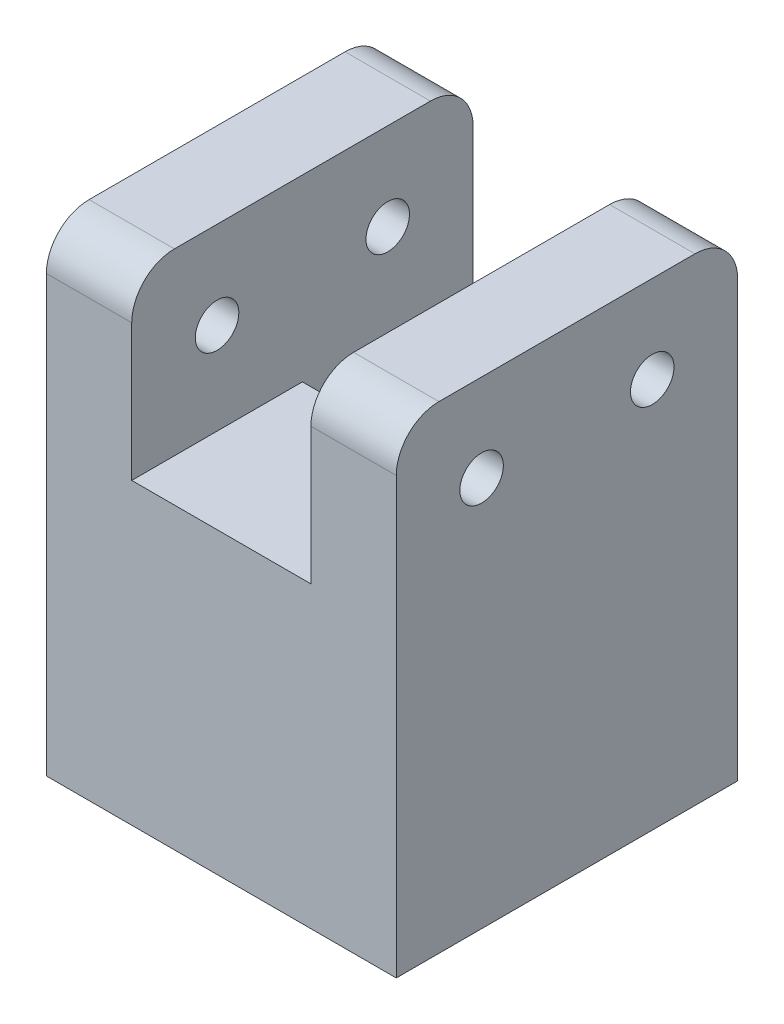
ISO-10303-21;
HEADER;
FILE_DESCRIPTION(('STEP AP214'),'2;1');
FILE_NAME('part.step','',(''),(''),'','','');
FILE_SCHEMA(('AUTOMOTIVE_DESIGN { 1 0 10303 214 1 1 1 1 }'));
ENDSEC;
DATA;
#1=APPLICATION_CONTEXT('core data for automotive mechanical design processes');
#2=APPLICATION_PROTOCOL_DEFINITION('international standard','automotive_design',2000,#1);
#3=PRODUCT_CONTEXT('',#1,'mechanical');
#4=PRODUCT('Part','Part','',(#3));
#5=PRODUCT_RELATED_PRODUCT_CATEGORY('part','',(#4));
#6=PRODUCT_DEFINITION_FORMATION('','',#4);
#7=PRODUCT_DEFINITION_CONTEXT('part definition',#1,'design');
#8=PRODUCT_DEFINITION('design','',#6,#7);
#9=PRODUCT_DEFINITION_SHAPE('','',#8);
#10=(LENGTH_UNIT() NAMED_UNIT(*) SI_UNIT(.MILLI.,.METRE.));
#11=(NAMED_UNIT(*) PLANE_ANGLE_UNIT() SI_UNIT($,.RADIAN.));
#12=(NAMED_UNIT(*) SI_UNIT($,.STERADIAN.) SOLID_ANGLE_UNIT());
#13=UNCERTAINTY_MEASURE_WITH_UNIT(LENGTH_MEASURE(1.E-05),#10,'distance_accuracy_value','');
#14=(GEOMETRIC_REPRESENTATION_CONTEXT(3) GLOBAL_UNCERTAINTY_ASSIGNED_CONTEXT((#13)) GLOBAL_UNIT_ASSIGNED_CONTEXT((#10,
#11,#12)) REPRESENTATION_CONTEXT('',''));
#15=CARTESIAN_POINT('',(0.,0.,0.));
#16=DIRECTION('',(0.,0.,1.));
#17=DIRECTION('',(1.,0.,0.));
#18=AXIS2_PLACEMENT_3D('',#15,#16,#17);
#19=CARTESIAN_POINT('',(20.5,20.5,20.));
#20=DIRECTION('',(1.,0.,0.));
#21=DIRECTION('',(0.,0.,-1.));
#22=AXIS2_PLACEMENT_3D('',#19,#20,#21);
#23=PLANE('',#22);
#24=CARTESIAN_POINT('',(20.5,10.25,-10.));
#25=DIRECTION('',(1.,0.,0.));
#26=DIRECTION('',(0.,0.,-1.));
#27=AXIS2_PLACEMENT_3D('',#24,#25,#26);
#28=CIRCLE('',#27,2.55);
#29=CARTESIAN_POINT('',(20.5,10.25,-12.55));
#30=VERTEX_POINT('',#29);
#31=EDGE_CURVE('E162',#30,#30,#28,.F.);
#32=ORIENTED_EDGE('',*,*,#31,.F.);
#33=EDGE_LOOP('',(#32));
#34=FACE_BOUND('',#33,.T.);
#35=CARTESIAN_POINT('',(20.5,10.25,10.));
#36=DIRECTION('',(1.,0.,0.));
#37=DIRECTION('',(0.,0.,-1.));
#38=AXIS2_PLACEMENT_3D('',#35,#36,#37);
#39=CIRCLE('',#38,2.55);
#40=CARTESIAN_POINT('',(20.5,10.25,7.45));
#41=VERTEX_POINT('',#40);
#42=EDGE_CURVE('E175',#41,#41,#39,.T.);
#43=ORIENTED_EDGE('',*,*,#42,.T.);
#44=EDGE_LOOP('',(#43));
#45=FACE_BOUND('',#44,.T.);
#46=DIRECTION('',(0.,-1.,0.));
#47=VECTOR('',#46,1.);
#48=CARTESIAN_POINT('',(20.5,20.5,20.));
#49=LINE('',#48,#47);
#50=CARTESIAN_POINT('',(20.5,15.5,20.));
#51=VERTEX_POINT('',#50);
#52=CARTESIAN_POINT('',(20.5,-0.5,20.));
#53=VERTEX_POINT('',#52);
#54=EDGE_CURVE('E174',#51,#53,#49,.T.);
#55=ORIENTED_EDGE('',*,*,#54,.F.);
#56=CARTESIAN_POINT('',(20.5,15.5,15.));
#57=DIRECTION('',(1.,0.,0.));
#58=DIRECTION('',(0.,0.,-1.));
#59=AXIS2_PLACEMENT_3D('',#56,#57,#58);
#60=CIRCLE('',#59,5.);
#61=CARTESIAN_POINT('',(20.5,20.5,15.));
#62=VERTEX_POINT('',#61);
#63=EDGE_CURVE('E218',#51,#62,#60,.F.);
#64=ORIENTED_EDGE('',*,*,#63,.T.);
#65=DIRECTION('',(0.,0.,-1.));
#66=VECTOR('',#65,1.);
#67=CARTESIAN_POINT('',(20.5,20.5,20.));
#68=LINE('',#67,#66);
#69=CARTESIAN_POINT('',(20.5,20.5,-15.));
#70=VERTEX_POINT('',#69);
#71=EDGE_CURVE('E186',#62,#70,#68,.T.);
#72=ORIENTED_EDGE('',*,*,#71,.T.);
#73=CARTESIAN_POINT('',(20.5,15.5,-15.));
#74=DIRECTION('',(1.,0.,0.));
#75=DIRECTION('',(0.,0.,-1.));
#76=AXIS2_PLACEMENT_3D('',#73,#74,#75);
#77=CIRCLE('',#76,5.);
#78=CARTESIAN_POINT('',(20.5,15.5,-20.));
#79=VERTEX_POINT('',#78);
#80=EDGE_CURVE('E215',#70,#79,#77,.F.);
#81=ORIENTED_EDGE('',*,*,#80,.T.);
#82=DIRECTION('',(0.,1.,0.));
#83=VECTOR('',#82,1.);
#84=CARTESIAN_POINT('',(20.5,-35.5,-20.));
#85=LINE('',#84,#83);
#86=CARTESIAN_POINT('',(20.5,-25.5,-20.));
#87=VERTEX_POINT('',#86);
#88=EDGE_CURVE('E274',#87,#79,#85,.T.);
#89=ORIENTED_EDGE('',*,*,#88,.F.);
#90=DIRECTION('',(0.,0.,1.));
#91=VECTOR('',#90,1.);
#92=CARTESIAN_POINT('',(20.5,-25.5,-20.));
#93=LINE('',#92,#91);
#94=CARTESIAN_POINT('',(20.5,-25.5,-5.));
#95=VERTEX_POINT('',#94);
#96=EDGE_CURVE('E268',#87,#95,#93,.T.);
#97=ORIENTED_EDGE('',*,*,#96,.T.);
#98=CARTESIAN_POINT('',(20.5,-20.5,-5.));
#99=DIRECTION('',(1.,0.,0.));
#100=DIRECTION('',(0.,0.,-1.));
#101=AXIS2_PLACEMENT_3D('',#98,#99,#100);
#102=CIRCLE('',#101,5.);
#103=CARTESIAN_POINT('',(20.5,-20.5,0.));
#104=VERTEX_POINT('',#103);
#105=EDGE_CURVE('E212',#95,#104,#102,.F.);
#106=ORIENTED_EDGE('',*,*,#105,.T.);
#107=DIRECTION('',(0.,1.,0.));
#108=VECTOR('',#107,1.);
#109=CARTESIAN_POINT('',(20.5,-35.5,0.));
#110=LINE('',#109,#108);
#111=CARTESIAN_POINT('',(20.5,-0.5,0.));
#112=VERTEX_POINT('',#111);
#113=EDGE_CURVE('E281',#104,#112,#110,.T.);
#114=ORIENTED_EDGE('',*,*,#113,.T.);
#115=DIRECTION('',(0.,0.,-1.));
#116=VECTOR('',#115,1.);
#117=CARTESIAN_POINT('',(20.5,-0.5,20.));
#118=LINE('',#117,#116);
#119=EDGE_CURVE('E172',#53,#112,#118,.T.);
#120=ORIENTED_EDGE('',*,*,#119,.F.);
#121=EDGE_LOOP('',(#55,#64,#72,#81,#89,#97,#106,#114,#120));
#122=FACE_BOUND('',#121,.T.);
#123=ADVANCED_FACE('F47',(#34,#45,#122),#23,.F.);
#124=CARTESIAN_POINT('',(-0.5,-0.5,20.));
#125=DIRECTION('',(-1.,0.,0.));
#126=DIRECTION('',(0.,0.,1.));
#127=AXIS2_PLACEMENT_3D('',#124,#125,#126);
#128=PLANE('',#127);
#129=CARTESIAN_POINT('',(-0.5,10.25,-10.));
#130=DIRECTION('',(-1.,0.,0.));
#131=DIRECTION('',(0.,0.,1.));
#132=AXIS2_PLACEMENT_3D('',#129,#130,#131);
#133=CIRCLE('',#132,2.55);
#134=CARTESIAN_POINT('',(-0.5,10.25,-7.45));
#135=VERTEX_POINT('',#134);
#136=EDGE_CURVE('E200',#135,#135,#133,.F.);
#137=ORIENTED_EDGE('',*,*,#136,.F.);
#138=EDGE_LOOP('',(#137));
#139=FACE_BOUND('',#138,.T.);
#140=CARTESIAN_POINT('',(-0.5,10.25,10.));
#141=DIRECTION('',(-1.,0.,0.));
#142=DIRECTION('',(0.,0.,1.));
#143=AXIS2_PLACEMENT_3D('',#140,#141,#142);
#144=CIRCLE('',#143,2.55);
#145=CARTESIAN_POINT('',(-0.499999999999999,10.25,7.45));
#146=VERTEX_POINT('',#145);
#147=EDGE_CURVE('E314',#146,#146,#144,.T.);
#148=ORIENTED_EDGE('',*,*,#147,.T.);
#149=EDGE_LOOP('',(#148));
#150=FACE_BOUND('',#149,.T.);
#151=DIRECTION('',(0.,0.,-1.));
#152=VECTOR('',#151,1.);
#153=CARTESIAN_POINT('',(-0.5,20.5,20.));
#154=LINE('',#153,#152);
#155=CARTESIAN_POINT('',(-0.5,20.5,15.));
#156=VERTEX_POINT('',#155);
#157=CARTESIAN_POINT('',(-0.5,20.5,-15.));
#158=VERTEX_POINT('',#157);
#159=EDGE_CURVE('E182',#156,#158,#154,.T.);
#160=ORIENTED_EDGE('',*,*,#159,.F.);
#161=CARTESIAN_POINT('',(-0.5,15.5,15.));
#162=DIRECTION('',(-1.,0.,0.));
#163=DIRECTION('',(0.,0.,1.));
#164=AXIS2_PLACEMENT_3D('',#161,#162,#163);
#165=CIRCLE('',#164,5.);
#166=CARTESIAN_POINT('',(-0.5,15.5,20.));
#167=VERTEX_POINT('',#166);
#168=EDGE_CURVE('E250',#156,#167,#165,.F.);
#169=ORIENTED_EDGE('',*,*,#168,.T.);
#170=DIRECTION('',(0.,1.,0.));
#171=VECTOR('',#170,1.);
#172=CARTESIAN_POINT('',(-0.5,-0.5,20.));
#173=LINE('',#172,#171);
#174=CARTESIAN_POINT('',(-0.5,-0.5,20.));
#175=VERTEX_POINT('',#174);
#176=EDGE_CURVE('E180',#175,#167,#173,.T.);
#177=ORIENTED_EDGE('',*,*,#176,.F.);
#178=DIRECTION('',(0.,0.,-1.));
#179=VECTOR('',#178,1.);
#180=CARTESIAN_POINT('',(-0.5,-0.5,20.));
#181=LINE('',#180,#179);
#182=CARTESIAN_POINT('',(-0.5,-0.500000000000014,0.));
#183=VERTEX_POINT('',#182);
#184=EDGE_CURVE('E169',#175,#183,#181,.T.);
#185=ORIENTED_EDGE('',*,*,#184,.T.);
#186=DIRECTION('',(0.,1.,0.));
#187=VECTOR('',#186,1.);
#188=CARTESIAN_POINT('',(-0.5,-35.5,0.));
#189=LINE('',#188,#187);
#190=CARTESIAN_POINT('',(-0.5,-20.5,0.));
#191=VERTEX_POINT('',#190);
#192=EDGE_CURVE('E153',#191,#183,#189,.T.);
#193=ORIENTED_EDGE('',*,*,#192,.F.);
#194=CARTESIAN_POINT('',(-0.5,-20.5,-5.));
#195=DIRECTION('',(-1.,0.,0.));
#196=DIRECTION('',(0.,0.,1.));
#197=AXIS2_PLACEMENT_3D('',#194,#195,#196);
#198=CIRCLE('',#197,5.);
#199=CARTESIAN_POINT('',(-0.5,-25.5,-5.));
#200=VERTEX_POINT('',#199);
#201=EDGE_CURVE('E245',#191,#200,#198,.F.);
#202=ORIENTED_EDGE('',*,*,#201,.T.);
#203=DIRECTION('',(0.,0.,1.));
#204=VECTOR('',#203,1.);
#205=CARTESIAN_POINT('',(-0.5,-25.5,-20.));
#206=LINE('',#205,#204);
#207=CARTESIAN_POINT('',(-0.5,-25.5,-20.));
#208=VERTEX_POINT('',#207);
#209=EDGE_CURVE('E269',#208,#200,#206,.T.);
#210=ORIENTED_EDGE('',*,*,#209,.F.);
#211=DIRECTION('',(0.,1.,0.));
#212=VECTOR('',#211,1.);
#213=CARTESIAN_POINT('',(-0.5,-35.5,-20.));
#214=LINE('',#213,#212);
#215=CARTESIAN_POINT('',(-0.5,15.5,-20.));
#216=VERTEX_POINT('',#215);
#217=EDGE_CURVE('E163',#208,#216,#214,.T.);
#218=ORIENTED_EDGE('',*,*,#217,.T.);
#219=CARTESIAN_POINT('',(-0.5,15.5,-15.));
#220=DIRECTION('',(-1.,0.,0.));
#221=DIRECTION('',(0.,0.,1.));
#222=AXIS2_PLACEMENT_3D('',#219,#220,#221);
#223=CIRCLE('',#222,5.);
#224=EDGE_CURVE('E69',#216,#158,#223,.F.);
#225=ORIENTED_EDGE('',*,*,#224,.T.);
#226=EDGE_LOOP('',(#160,#169,#177,#185,#193,#202,#210,#218,#225));
#227=FACE_BOUND('',#226,.T.);
#228=ADVANCED_FACE('F178',(#139,#150,#227),#128,.F.);
#229=CARTESIAN_POINT('',(20.5,-35.5,0.));
#230=DIRECTION('',(0.,0.,1.));
#231=DIRECTION('',(1.,0.,0.));
#232=AXIS2_PLACEMENT_3D('',#229,#230,#231);
#233=PLANE('',#232);
#234=ORIENTED_EDGE('',*,*,#113,.F.);
#235=DIRECTION('',(1.,0.,0.));
#236=VECTOR('',#235,1.);
#237=CARTESIAN_POINT('',(-0.5,-20.5,0.));
#238=LINE('',#237,#236);
#239=EDGE_CURVE('E11',#104,#191,#238,.F.);
#240=ORIENTED_EDGE('',*,*,#239,.T.);
#241=ORIENTED_EDGE('',*,*,#192,.T.);
#242=DIRECTION('',(-1.,0.,0.));
#243=VECTOR('',#242,1.);
#244=CARTESIAN_POINT('',(20.5,-0.5,0.));
#245=LINE('',#244,#243);
#246=EDGE_CURVE('E156',#112,#183,#245,.T.);
#247=ORIENTED_EDGE('',*,*,#246,.F.);
#248=EDGE_LOOP('',(#234,#240,#241,#247));
#249=FACE_BOUND('',#248,.T.);
#250=ADVANCED_FACE('F155',(#249),#233,.F.);
#251=CARTESIAN_POINT('',(-0.5,20.5,20.));
#252=DIRECTION('',(0.,-1.,0.));
#253=DIRECTION('',(0.,0.,-1.));
#254=AXIS2_PLACEMENT_3D('',#251,#252,#253);
#255=PLANE('',#254);
#256=DIRECTION('',(0.,0.,-1.));
#257=VECTOR('',#256,1.);
#258=CARTESIAN_POINT('',(-10.5,20.5,20.));
#259=LINE('',#258,#257);
#260=CARTESIAN_POINT('',(-10.5,20.5,15.));
#261=VERTEX_POINT('',#260);
#262=CARTESIAN_POINT('',(-10.5,20.5,-15.));
#263=VERTEX_POINT('',#262);
#264=EDGE_CURVE('E189',#261,#263,#259,.T.);
#265=ORIENTED_EDGE('',*,*,#264,.F.);
#266=DIRECTION('',(-1.,0.,0.));
#267=VECTOR('',#266,1.);
#268=CARTESIAN_POINT('',(-0.5,20.5,15.));
#269=LINE('',#268,#267);
#270=EDGE_CURVE('E242',#261,#156,#269,.F.);
#271=ORIENTED_EDGE('',*,*,#270,.T.);
#272=ORIENTED_EDGE('',*,*,#159,.T.);
#273=DIRECTION('',(1.,0.,0.));
#274=VECTOR('',#273,1.);
#275=CARTESIAN_POINT('',(-10.5,20.5,-15.));
#276=LINE('',#275,#274);
#277=EDGE_CURVE('E239',#158,#263,#276,.F.);
#278=ORIENTED_EDGE('',*,*,#277,.T.);
#279=EDGE_LOOP('',(#265,#271,#272,#278));
#280=FACE_BOUND('',#279,.T.);
#281=ADVANCED_FACE('F448',(#280),#255,.F.);
#282=CARTESIAN_POINT('',(30.5,10.25,-10.));
#283=DIRECTION('',(-1.,0.,0.));
#284=DIRECTION('',(0.,0.,1.));
#285=AXIS2_PLACEMENT_3D('',#282,#283,#284);
#286=CYLINDRICAL_SURFACE('',#285,2.55);
#287=ORIENTED_EDGE('',*,*,#136,.T.);
#288=EDGE_LOOP('',(#287));
#289=FACE_BOUND('',#288,.T.);
#290=CARTESIAN_POINT('',(-10.5,10.25,-10.));
#291=DIRECTION('',(-1.,0.,0.));
#292=DIRECTION('',(0.,0.,1.));
#293=AXIS2_PLACEMENT_3D('',#290,#291,#292);
#294=CIRCLE('',#293,2.55);
#295=CARTESIAN_POINT('',(-10.5,10.25,-7.45));
#296=VERTEX_POINT('',#295);
#297=EDGE_CURVE('E204',#296,#296,#294,.T.);
#298=ORIENTED_EDGE('',*,*,#297,.T.);
#299=EDGE_LOOP('',(#298));
#300=FACE_BOUND('',#299,.T.);
#301=ADVANCED_FACE('F457',(#289,#300),#286,.F.);
#302=CARTESIAN_POINT('',(20.5,-0.5,20.));
#303=DIRECTION('',(0.,-1.,0.));
#304=DIRECTION('',(0.,0.,-1.));
#305=AXIS2_PLACEMENT_3D('',#302,#303,#304);
#306=PLANE('',#305);
#307=ORIENTED_EDGE('',*,*,#246,.T.);
#308=ORIENTED_EDGE('',*,*,#184,.F.);
#309=DIRECTION('',(-1.,0.,0.));
#310=VECTOR('',#309,1.);
#311=CARTESIAN_POINT('',(20.5,-0.5,20.));
#312=LINE('',#311,#310);
#313=EDGE_CURVE('E326',#53,#175,#312,.T.);
#314=ORIENTED_EDGE('',*,*,#313,.F.);
#315=ORIENTED_EDGE('',*,*,#119,.T.);
#316=EDGE_LOOP('',(#307,#308,#314,#315));
#317=FACE_BOUND('',#316,.T.);
#318=ADVANCED_FACE('F167',(#317),#306,.F.);
#319=ORIENTED_EDGE('',*,*,#71,.F.);
#320=DIRECTION('',(-1.,0.,0.));
#321=VECTOR('',#320,1.);
#322=CARTESIAN_POINT('',(30.5,20.5,15.));
#323=LINE('',#322,#321);
#324=CARTESIAN_POINT('',(30.5,20.5,15.));
#325=VERTEX_POINT('',#324);
#326=EDGE_CURVE('E224',#62,#325,#323,.F.);
#327=ORIENTED_EDGE('',*,*,#326,.T.);
#328=DIRECTION('',(0.,0.,-1.));
#329=VECTOR('',#328,1.);
#330=CARTESIAN_POINT('',(30.5,20.5,20.));
#331=LINE('',#330,#329);
#332=CARTESIAN_POINT('',(30.5,20.5,-15.));
#333=VERTEX_POINT('',#332);
#334=EDGE_CURVE('E340',#325,#333,#331,.T.);
#335=ORIENTED_EDGE('',*,*,#334,.T.);
#336=DIRECTION('',(1.,0.,0.));
#337=VECTOR('',#336,1.);
#338=CARTESIAN_POINT('',(20.5,20.5,-15.));
#339=LINE('',#338,#337);
#340=EDGE_CURVE('E221',#333,#70,#339,.F.);
#341=ORIENTED_EDGE('',*,*,#340,.T.);
#342=EDGE_LOOP('',(#319,#327,#335,#341));
#343=FACE_BOUND('',#342,.T.);
#344=ADVANCED_FACE('F459',(#343),#255,.F.);
#345=CARTESIAN_POINT('',(-10.5,-20.5,20.));
#346=DIRECTION('',(1.,0.,0.));
#347=DIRECTION('',(0.,0.,-1.));
#348=AXIS2_PLACEMENT_3D('',#345,#346,#347);
#349=PLANE('',#348);
#350=ORIENTED_EDGE('',*,*,#297,.F.);
#351=EDGE_LOOP('',(#350));
#352=FACE_BOUND('',#351,.T.);
#353=CARTESIAN_POINT('',(-10.5,10.25,10.));
#354=DIRECTION('',(1.,0.,0.));
#355=DIRECTION('',(0.,0.,-1.));
#356=AXIS2_PLACEMENT_3D('',#353,#354,#355);
#357=CIRCLE('',#356,2.55);
#358=CARTESIAN_POINT('',(-10.5,10.25,7.45));
#359=VERTEX_POINT('',#358);
#360=EDGE_CURVE('E309',#359,#359,#357,.T.);
#361=ORIENTED_EDGE('',*,*,#360,.T.);
#362=EDGE_LOOP('',(#361));
#363=FACE_BOUND('',#362,.T.);
#364=DIRECTION('',(0.,-1.,0.));
#365=VECTOR('',#364,1.);
#366=CARTESIAN_POINT('',(-10.5,20.5,20.));
#367=LINE('',#366,#365);
#368=CARTESIAN_POINT('',(-10.5,15.5,20.));
#369=VERTEX_POINT('',#368);
#370=CARTESIAN_POINT('',(-10.5,-35.5,20.));
#371=VERTEX_POINT('',#370);
#372=EDGE_CURVE('E331',#369,#371,#367,.T.);
#373=ORIENTED_EDGE('',*,*,#372,.F.);
#374=CARTESIAN_POINT('',(-10.5,15.5,15.));
#375=DIRECTION('',(1.,0.,0.));
#376=DIRECTION('',(0.,0.,-1.));
#377=AXIS2_PLACEMENT_3D('',#374,#375,#376);
#378=CIRCLE('',#377,5.);
#379=EDGE_CURVE('E236',#369,#261,#378,.F.);
#380=ORIENTED_EDGE('',*,*,#379,.T.);
#381=ORIENTED_EDGE('',*,*,#264,.T.);
#382=CARTESIAN_POINT('',(-10.5,15.5,-15.));
#383=DIRECTION('',(1.,0.,0.));
#384=DIRECTION('',(0.,0.,-1.));
#385=AXIS2_PLACEMENT_3D('',#382,#383,#384);
#386=CIRCLE('',#385,5.);
#387=CARTESIAN_POINT('',(-10.5,15.5,-20.));
#388=VERTEX_POINT('',#387);
#389=EDGE_CURVE('E233',#263,#388,#386,.F.);
#390=ORIENTED_EDGE('',*,*,#389,.T.);
#391=DIRECTION('',(0.,1.,0.));
#392=VECTOR('',#391,1.);
#393=CARTESIAN_POINT('',(-10.5,20.5,-20.));
#394=LINE('',#393,#392);
#395=CARTESIAN_POINT('',(-10.5,-35.5,-20.));
#396=VERTEX_POINT('',#395);
#397=EDGE_CURVE('E305',#396,#388,#394,.T.);
#398=ORIENTED_EDGE('',*,*,#397,.F.);
#399=DIRECTION('',(0.,0.,-1.));
#400=VECTOR('',#399,1.);
#401=CARTESIAN_POINT('',(-10.5,-35.5,20.));
#402=LINE('',#401,#400);
#403=EDGE_CURVE('E349',#371,#396,#402,.T.);
#404=ORIENTED_EDGE('',*,*,#403,.F.);
#405=EDGE_LOOP('',(#373,#380,#381,#390,#398,#404));
#406=FACE_BOUND('',#405,.T.);
#407=ADVANCED_FACE('F358',(#352,#363,#406),#349,.F.);
#408=CARTESIAN_POINT('',(-10.5,-35.5,20.));
#409=DIRECTION('',(0.,1.,0.));
#410=DIRECTION('',(0.,0.,1.));
#411=AXIS2_PLACEMENT_3D('',#408,#409,#410);
#412=PLANE('',#411);
#413=ORIENTED_EDGE('',*,*,#403,.T.);
#414=DIRECTION('',(-1.,0.,0.));
#415=VECTOR('',#414,1.);
#416=CARTESIAN_POINT('',(30.5,-35.5,-20.));
#417=LINE('',#416,#415);
#418=CARTESIAN_POINT('',(30.5,-35.5,-20.));
#419=VERTEX_POINT('',#418);
#420=EDGE_CURVE('E302',#419,#396,#417,.T.);
#421=ORIENTED_EDGE('',*,*,#420,.F.);
#422=DIRECTION('',(0.,0.,-1.));
#423=VECTOR('',#422,1.);
#424=CARTESIAN_POINT('',(30.5,-35.5,20.));
#425=LINE('',#424,#423);
#426=CARTESIAN_POINT('',(30.5,-35.5,20.));
#427=VERTEX_POINT('',#426);
#428=EDGE_CURVE('E345',#427,#419,#425,.T.);
#429=ORIENTED_EDGE('',*,*,#428,.F.);
#430=DIRECTION('',(1.,0.,0.));
#431=VECTOR('',#430,1.);
#432=CARTESIAN_POINT('',(-10.5,-35.5,20.));
#433=LINE('',#432,#431);
#434=EDGE_CURVE('E334',#371,#427,#433,.T.);
#435=ORIENTED_EDGE('',*,*,#434,.F.);
#436=EDGE_LOOP('',(#413,#421,#429,#435));
#437=FACE_BOUND('',#436,.T.);
#438=ADVANCED_FACE('F525',(#437),#412,.F.);
#439=CARTESIAN_POINT('',(30.5,-20.5,20.));
#440=DIRECTION('',(-1.,0.,0.));
#441=DIRECTION('',(0.,0.,1.));
#442=AXIS2_PLACEMENT_3D('',#439,#440,#441);
#443=PLANE('',#442);
#444=CARTESIAN_POINT('',(30.5,10.25,-10.));
#445=DIRECTION('',(-1.,0.,0.));
#446=DIRECTION('',(0.,0.,1.));
#447=AXIS2_PLACEMENT_3D('',#444,#445,#446);
#448=CIRCLE('',#447,2.55);
#449=CARTESIAN_POINT('',(30.5,10.25,-7.45));
#450=VERTEX_POINT('',#449);
#451=EDGE_CURVE('E292',#450,#450,#448,.T.);
#452=ORIENTED_EDGE('',*,*,#451,.T.);
#453=EDGE_LOOP('',(#452));
#454=FACE_BOUND('',#453,.T.);
#455=CARTESIAN_POINT('',(30.5,10.25,10.));
#456=DIRECTION('',(1.,0.,0.));
#457=DIRECTION('',(0.,0.,-1.));
#458=AXIS2_PLACEMENT_3D('',#455,#456,#457);
#459=CIRCLE('',#458,2.55);
#460=CARTESIAN_POINT('',(30.5,10.25,7.45));
#461=VERTEX_POINT('',#460);
#462=EDGE_CURVE('E310',#461,#461,#459,.T.);
#463=ORIENTED_EDGE('',*,*,#462,.F.);
#464=EDGE_LOOP('',(#463));
#465=FACE_BOUND('',#464,.T.);
#466=ORIENTED_EDGE('',*,*,#334,.F.);
#467=CARTESIAN_POINT('',(30.5,15.5,15.));
#468=DIRECTION('',(-1.,0.,0.));
#469=DIRECTION('',(0.,0.,1.));
#470=AXIS2_PLACEMENT_3D('',#467,#468,#469);
#471=CIRCLE('',#470,5.);
#472=CARTESIAN_POINT('',(30.5,15.5,20.));
#473=VERTEX_POINT('',#472);
#474=EDGE_CURVE('E230',#325,#473,#471,.F.);
#475=ORIENTED_EDGE('',*,*,#474,.T.);
#476=DIRECTION('',(0.,1.,0.));
#477=VECTOR('',#476,1.);
#478=CARTESIAN_POINT('',(30.5,-35.5,20.));
#479=LINE('',#478,#477);
#480=EDGE_CURVE('E337',#427,#473,#479,.T.);
#481=ORIENTED_EDGE('',*,*,#480,.F.);
#482=ORIENTED_EDGE('',*,*,#428,.T.);
#483=DIRECTION('',(0.,-1.,0.));
#484=VECTOR('',#483,1.);
#485=CARTESIAN_POINT('',(30.5,20.5,-20.));
#486=LINE('',#485,#484);
#487=CARTESIAN_POINT('',(30.5,15.5,-20.));
#488=VERTEX_POINT('',#487);
#489=EDGE_CURVE('E296',#488,#419,#486,.T.);
#490=ORIENTED_EDGE('',*,*,#489,.F.);
#491=CARTESIAN_POINT('',(30.5,15.5,-15.));
#492=DIRECTION('',(-1.,0.,0.));
#493=DIRECTION('',(0.,0.,1.));
#494=AXIS2_PLACEMENT_3D('',#491,#492,#493);
#495=CIRCLE('',#494,5.);
#496=EDGE_CURVE('E227',#488,#333,#495,.F.);
#497=ORIENTED_EDGE('',*,*,#496,.T.);
#498=EDGE_LOOP('',(#466,#475,#481,#482,#490,#497));
#499=FACE_BOUND('',#498,.T.);
#500=ADVANCED_FACE('F515',(#454,#465,#499),#443,.F.);
#501=CARTESIAN_POINT('',(0.,0.,20.));
#502=DIRECTION('',(0.,0.,1.));
#503=DIRECTION('',(1.,0.,0.));
#504=AXIS2_PLACEMENT_3D('',#501,#502,#503);
#505=PLANE('',#504);
#506=ORIENTED_EDGE('',*,*,#480,.T.);
#507=DIRECTION('',(-1.,0.,0.));
#508=VECTOR('',#507,1.);
#509=CARTESIAN_POINT('',(20.5,15.5,20.));
#510=LINE('',#509,#508);
#511=EDGE_CURVE('E208',#473,#51,#510,.T.);
#512=ORIENTED_EDGE('',*,*,#511,.T.);
#513=ORIENTED_EDGE('',*,*,#54,.T.);
#514=ORIENTED_EDGE('',*,*,#313,.T.);
#515=ORIENTED_EDGE('',*,*,#176,.T.);
#516=DIRECTION('',(-1.,0.,0.));
#517=VECTOR('',#516,1.);
#518=CARTESIAN_POINT('',(-10.5,15.5,20.));
#519=LINE('',#518,#517);
#520=EDGE_CURVE('E196',#167,#369,#519,.T.);
#521=ORIENTED_EDGE('',*,*,#520,.T.);
#522=ORIENTED_EDGE('',*,*,#372,.T.);
#523=ORIENTED_EDGE('',*,*,#434,.T.);
#524=EDGE_LOOP('',(#506,#512,#513,#514,#515,#521,#522,#523));
#525=FACE_BOUND('',#524,.T.);
#526=ADVANCED_FACE('F506',(#525),#505,.T.);
#527=CARTESIAN_POINT('',(-10.5,10.25,10.));
#528=DIRECTION('',(1.,0.,0.));
#529=DIRECTION('',(0.,0.,-1.));
#530=AXIS2_PLACEMENT_3D('',#527,#528,#529);
#531=CYLINDRICAL_SURFACE('',#530,2.55);
#532=CARTESIAN_POINT('',(30.5,10.25,7.45));
#533=CARTESIAN_POINT('',(30.3958333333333,10.25,7.45));
#534=CARTESIAN_POINT('',(30.2916666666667,10.25,7.45));
#535=CARTESIAN_POINT('',(30.0833333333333,10.25,7.45));
#536=CARTESIAN_POINT('',(29.9791666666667,10.25,7.45));
#537=CARTESIAN_POINT('',(29.7708333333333,10.25,7.45));
#538=CARTESIAN_POINT('',(29.6666666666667,10.25,7.45));
#539=CARTESIAN_POINT('',(29.4583333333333,10.25,7.45));
#540=CARTESIAN_POINT('',(29.3541666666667,10.25,7.45));
#541=CARTESIAN_POINT('',(29.1458333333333,10.25,7.45));
#542=CARTESIAN_POINT('',(29.0416666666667,10.25,7.45));
#543=CARTESIAN_POINT('',(28.8333333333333,10.25,7.45));
#544=CARTESIAN_POINT('',(28.7291666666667,10.25,7.45));
#545=CARTESIAN_POINT('',(28.5208333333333,10.25,7.45));
#546=CARTESIAN_POINT('',(28.4166666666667,10.25,7.45));
#547=CARTESIAN_POINT('',(28.2083333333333,10.25,7.45));
#548=CARTESIAN_POINT('',(28.1041666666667,10.25,7.45));
#549=CARTESIAN_POINT('',(27.8958333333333,10.25,7.45));
#550=CARTESIAN_POINT('',(27.7916666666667,10.25,7.45));
#551=CARTESIAN_POINT('',(27.5833333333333,10.25,7.45));
#552=CARTESIAN_POINT('',(27.4791666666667,10.25,7.45));
#553=CARTESIAN_POINT('',(27.2708333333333,10.25,7.45));
#554=CARTESIAN_POINT('',(27.1666666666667,10.25,7.45));
#555=CARTESIAN_POINT('',(26.9583333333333,10.25,7.45));
#556=CARTESIAN_POINT('',(26.8541666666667,10.25,7.45));
#557=CARTESIAN_POINT('',(26.6458333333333,10.25,7.45));
#558=CARTESIAN_POINT('',(26.5416666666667,10.25,7.45));
#559=CARTESIAN_POINT('',(26.3333333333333,10.25,7.45));
#560=CARTESIAN_POINT('',(26.2291666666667,10.25,7.45));
#561=CARTESIAN_POINT('',(26.0208333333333,10.25,7.45));
#562=CARTESIAN_POINT('',(25.9166666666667,10.25,7.45));
#563=CARTESIAN_POINT('',(25.7083333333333,10.25,7.45));
#564=CARTESIAN_POINT('',(25.6041666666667,10.25,7.45));
#565=CARTESIAN_POINT('',(25.3958333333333,10.25,7.45));
#566=CARTESIAN_POINT('',(25.2916666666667,10.25,7.45));
#567=CARTESIAN_POINT('',(25.0833333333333,10.25,7.45));
#568=CARTESIAN_POINT('',(24.9791666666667,10.25,7.45));
#569=CARTESIAN_POINT('',(24.7708333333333,10.25,7.45));
#570=CARTESIAN_POINT('',(24.6666666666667,10.25,7.45));
#571=CARTESIAN_POINT('',(24.4583333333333,10.25,7.45));
#572=CARTESIAN_POINT('',(24.3541666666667,10.25,7.45));
#573=CARTESIAN_POINT('',(24.1458333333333,10.25,7.45));
#574=CARTESIAN_POINT('',(24.0416666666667,10.25,7.45));
#575=CARTESIAN_POINT('',(23.8333333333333,10.25,7.45));
#576=CARTESIAN_POINT('',(23.7291666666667,10.25,7.45));
#577=CARTESIAN_POINT('',(23.5208333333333,10.25,7.45));
#578=CARTESIAN_POINT('',(23.4166666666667,10.25,7.45));
#579=CARTESIAN_POINT('',(23.2083333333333,10.25,7.45));
#580=CARTESIAN_POINT('',(23.1041666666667,10.25,7.45));
#581=CARTESIAN_POINT('',(22.8958333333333,10.25,7.45));
#582=CARTESIAN_POINT('',(22.7916666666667,10.25,7.45));
#583=CARTESIAN_POINT('',(22.5833333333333,10.25,7.45));
#584=CARTESIAN_POINT('',(22.4791666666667,10.25,7.45));
#585=CARTESIAN_POINT('',(22.2708333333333,10.25,7.45));
#586=CARTESIAN_POINT('',(22.1666666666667,10.25,7.45));
#587=CARTESIAN_POINT('',(21.9583333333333,10.25,7.45));
#588=CARTESIAN_POINT('',(21.8541666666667,10.25,7.45));
#589=CARTESIAN_POINT('',(21.6458333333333,10.25,7.45));
#590=CARTESIAN_POINT('',(21.5416666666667,10.25,7.45));
#591=CARTESIAN_POINT('',(21.3333333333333,10.25,7.45));
#592=CARTESIAN_POINT('',(21.2291666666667,10.25,7.45));
#593=CARTESIAN_POINT('',(21.0208333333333,10.25,7.45));
#594=CARTESIAN_POINT('',(20.9166666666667,10.25,7.45));
#595=CARTESIAN_POINT('',(20.7083333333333,10.25,7.45));
#596=CARTESIAN_POINT('',(20.6041666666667,10.25,7.45));
#597=CARTESIAN_POINT('',(20.5,10.25,7.45));
#598=B_SPLINE_CURVE_WITH_KNOTS('',3,(#532,#533,#534,#535,#536,#537,#538,#539,#540,#541,#542,
#543,#544,#545,#546,#547,#548,#549,#550,#551,#552,#553,#554,#555,#556,#557,#558,#559,#560,#561,
#562,#563,#564,#565,#566,#567,#568,#569,#570,#571,#572,#573,#574,#575,#576,#577,#578,#579,#580,
#581,#582,#583,#584,#585,#586,#587,#588,#589,#590,#591,#592,#593,#594,#595,#596,#597),
.UNSPECIFIED.,.F.,.F.,(4,2,2,2,2,2,2,2,2,2,2,2,2,2,2,2,2,2,2,2,2,2,2,2,2,2,2,2,2,2,2,2,4),(0.,
0.3125,0.625000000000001,0.937500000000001,1.25,1.5625,1.875,2.1875,2.5,2.8125,3.125,3.4375,
3.75,4.0625,4.375,4.6875,5.,5.3125,5.62500000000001,5.9375,6.25,6.5625,6.875,7.1875,7.5,7.8125,
8.125,8.4375,8.75,9.0625,9.375,9.6875,10.),.UNSPECIFIED.);
#599=EDGE_CURVE('BSEAM496',#461,#41,#598,.T.);
#600=ORIENTED_EDGE('',*,*,#462,.T.);
#601=ORIENTED_EDGE('',*,*,#42,.F.);
#602=ORIENTED_EDGE('',*,*,#599,.T.);
#603=ORIENTED_EDGE('',*,*,#599,.F.);
#604=EDGE_LOOP('',(#600,#602,#601,#603));
#605=FACE_BOUND('',#604,.T.);
#606=ADVANCED_FACE('F496',(#605),#531,.F.);
#607=CARTESIAN_POINT('',(-10.5,10.25,7.45));
#608=CARTESIAN_POINT('',(-10.3958333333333,10.25,7.45));
#609=CARTESIAN_POINT('',(-10.2916666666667,10.25,7.45));
#610=CARTESIAN_POINT('',(-10.0833333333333,10.25,7.45));
#611=CARTESIAN_POINT('',(-9.97916666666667,10.25,7.45));
#612=CARTESIAN_POINT('',(-9.77083333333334,10.25,7.45));
#613=CARTESIAN_POINT('',(-9.66666666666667,10.25,7.45));
#614=CARTESIAN_POINT('',(-9.45833333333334,10.25,7.45));
#615=CARTESIAN_POINT('',(-9.35416666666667,10.25,7.45));
#616=CARTESIAN_POINT('',(-9.14583333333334,10.25,7.45));
#617=CARTESIAN_POINT('',(-9.04166666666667,10.25,7.45));
#618=CARTESIAN_POINT('',(-8.83333333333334,10.25,7.45));
#619=CARTESIAN_POINT('',(-8.72916666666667,10.25,7.45));
#620=CARTESIAN_POINT('',(-8.52083333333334,10.25,7.45));
#621=CARTESIAN_POINT('',(-8.41666666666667,10.25,7.45));
#622=CARTESIAN_POINT('',(-8.20833333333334,10.25,7.45));
#623=CARTESIAN_POINT('',(-8.10416666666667,10.25,7.45));
#624=CARTESIAN_POINT('',(-7.89583333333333,10.25,7.45));
#625=CARTESIAN_POINT('',(-7.79166666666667,10.25,7.45));
#626=CARTESIAN_POINT('',(-7.58333333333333,10.25,7.45));
#627=CARTESIAN_POINT('',(-7.47916666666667,10.25,7.45));
#628=CARTESIAN_POINT('',(-7.27083333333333,10.25,7.45));
#629=CARTESIAN_POINT('',(-7.16666666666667,10.25,7.45));
#630=CARTESIAN_POINT('',(-6.95833333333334,10.25,7.45));
#631=CARTESIAN_POINT('',(-6.85416666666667,10.25,7.45));
#632=CARTESIAN_POINT('',(-6.64583333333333,10.25,7.45));
#633=CARTESIAN_POINT('',(-6.54166666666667,10.25,7.45));
#634=CARTESIAN_POINT('',(-6.33333333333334,10.25,7.45));
#635=CARTESIAN_POINT('',(-6.22916666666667,10.25,7.45));
#636=CARTESIAN_POINT('',(-6.02083333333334,10.25,7.45));
#637=CARTESIAN_POINT('',(-5.91666666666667,10.25,7.45));
#638=CARTESIAN_POINT('',(-5.70833333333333,10.25,7.45));
#639=CARTESIAN_POINT('',(-5.60416666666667,10.25,7.45));
#640=CARTESIAN_POINT('',(-5.39583333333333,10.25,7.45));
#641=CARTESIAN_POINT('',(-5.29166666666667,10.25,7.45));
#642=CARTESIAN_POINT('',(-5.08333333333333,10.25,7.45));
#643=CARTESIAN_POINT('',(-4.97916666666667,10.25,7.45));
#644=CARTESIAN_POINT('',(-4.77083333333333,10.25,7.45));
#645=CARTESIAN_POINT('',(-4.66666666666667,10.25,7.45));
#646=CARTESIAN_POINT('',(-4.45833333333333,10.25,7.45));
#647=CARTESIAN_POINT('',(-4.35416666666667,10.25,7.45));
#648=CARTESIAN_POINT('',(-4.14583333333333,10.25,7.45));
#649=CARTESIAN_POINT('',(-4.04166666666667,10.25,7.45));
#650=CARTESIAN_POINT('',(-3.83333333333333,10.25,7.45));
#651=CARTESIAN_POINT('',(-3.72916666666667,10.25,7.45));
#652=CARTESIAN_POINT('',(-3.52083333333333,10.25,7.45));
#653=CARTESIAN_POINT('',(-3.41666666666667,10.25,7.45));
#654=CARTESIAN_POINT('',(-3.20833333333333,10.25,7.45));
#655=CARTESIAN_POINT('',(-3.10416666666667,10.25,7.45));
#656=CARTESIAN_POINT('',(-2.89583333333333,10.25,7.45));
#657=CARTESIAN_POINT('',(-2.79166666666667,10.25,7.45));
#658=CARTESIAN_POINT('',(-2.58333333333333,10.25,7.45));
#659=CARTESIAN_POINT('',(-2.47916666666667,10.25,7.45));
#660=CARTESIAN_POINT('',(-2.27083333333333,10.25,7.45));
#661=CARTESIAN_POINT('',(-2.16666666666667,10.25,7.45));
#662=CARTESIAN_POINT('',(-1.95833333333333,10.25,7.45));
#663=CARTESIAN_POINT('',(-1.85416666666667,10.25,7.45));
#664=CARTESIAN_POINT('',(-1.64583333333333,10.25,7.45));
#665=CARTESIAN_POINT('',(-1.54166666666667,10.25,7.45));
#666=CARTESIAN_POINT('',(-1.33333333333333,10.25,7.45));
#667=CARTESIAN_POINT('',(-1.22916666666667,10.25,7.45));
#668=CARTESIAN_POINT('',(-1.02083333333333,10.25,7.45));
#669=CARTESIAN_POINT('',(-0.916666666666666,10.25,7.45));
#670=CARTESIAN_POINT('',(-0.708333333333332,10.25,7.45));
#671=CARTESIAN_POINT('',(-0.604166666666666,10.25,7.45));
#672=CARTESIAN_POINT('',(-0.499999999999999,10.25,7.45));
#673=B_SPLINE_CURVE_WITH_KNOTS('',3,(#607,#608,#609,#610,#611,#612,#613,#614,#615,#616,#617,
#618,#619,#620,#621,#622,#623,#624,#625,#626,#627,#628,#629,#630,#631,#632,#633,#634,#635,#636,
#637,#638,#639,#640,#641,#642,#643,#644,#645,#646,#647,#648,#649,#650,#651,#652,#653,#654,#655,
#656,#657,#658,#659,#660,#661,#662,#663,#664,#665,#666,#667,#668,#669,#670,#671,#672),
.UNSPECIFIED.,.F.,.F.,(4,2,2,2,2,2,2,2,2,2,2,2,2,2,2,2,2,2,2,2,2,2,2,2,2,2,2,2,2,2,2,2,4),(0.,
0.312499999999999,0.624999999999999,0.937499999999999,1.25,1.5625,1.875,2.1875,2.5,2.8125,3.125,
3.4375,3.75,4.0625,4.375,4.6875,5.,5.3125,5.625,5.9375,6.25,6.5625,6.875,7.1875,7.5,7.8125,
8.125,8.4375,8.75,9.0625,9.375,9.6875,10.),.UNSPECIFIED.);
#674=EDGE_CURVE('BSEAM488',#359,#146,#673,.T.);
#675=ORIENTED_EDGE('',*,*,#360,.F.);
#676=ORIENTED_EDGE('',*,*,#147,.F.);
#677=ORIENTED_EDGE('',*,*,#674,.T.);
#678=ORIENTED_EDGE('',*,*,#674,.F.);
#679=EDGE_LOOP('',(#675,#677,#676,#678));
#680=FACE_BOUND('',#679,.T.);
#681=ADVANCED_FACE('F488',(#680),#531,.F.);
#682=CARTESIAN_POINT('',(0.,0.,-20.));
#683=DIRECTION('',(0.,0.,-1.));
#684=DIRECTION('',(-1.,0.,0.));
#685=AXIS2_PLACEMENT_3D('',#682,#683,#684);
#686=PLANE('',#685);
#687=ORIENTED_EDGE('',*,*,#397,.T.);
#688=DIRECTION('',(1.,0.,0.));
#689=VECTOR('',#688,1.);
#690=CARTESIAN_POINT('',(-0.5,15.5,-20.));
#691=LINE('',#690,#689);
#692=EDGE_CURVE('E257',#388,#216,#691,.T.);
#693=ORIENTED_EDGE('',*,*,#692,.T.);
#694=ORIENTED_EDGE('',*,*,#217,.F.);
#695=DIRECTION('',(1.,0.,0.));
#696=VECTOR('',#695,1.);
#697=CARTESIAN_POINT('',(20.5,-25.5,-20.));
#698=LINE('',#697,#696);
#699=EDGE_CURVE('E277',#208,#87,#698,.T.);
#700=ORIENTED_EDGE('',*,*,#699,.T.);
#701=ORIENTED_EDGE('',*,*,#88,.T.);
#702=DIRECTION('',(1.,0.,0.));
#703=VECTOR('',#702,1.);
#704=CARTESIAN_POINT('',(30.5,15.5,-20.));
#705=LINE('',#704,#703);
#706=EDGE_CURVE('E253',#79,#488,#705,.T.);
#707=ORIENTED_EDGE('',*,*,#706,.T.);
#708=ORIENTED_EDGE('',*,*,#489,.T.);
#709=ORIENTED_EDGE('',*,*,#420,.T.);
#710=EDGE_LOOP('',(#687,#693,#694,#700,#701,#707,#708,#709));
#711=FACE_BOUND('',#710,.T.);
#712=ADVANCED_FACE('F365',(#711),#686,.T.);
#713=ORIENTED_EDGE('',*,*,#31,.T.);
#714=EDGE_LOOP('',(#713));
#715=FACE_BOUND('',#714,.T.);
#716=ORIENTED_EDGE('',*,*,#451,.F.);
#717=EDGE_LOOP('',(#716));
#718=FACE_BOUND('',#717,.T.);
#719=ADVANCED_FACE('F425',(#715,#718),#286,.F.);
#720=CARTESIAN_POINT('',(20.5,-25.5,-20.));
#721=DIRECTION('',(0.,-1.,0.));
#722=DIRECTION('',(0.,0.,-1.));
#723=AXIS2_PLACEMENT_3D('',#720,#721,#722);
#724=PLANE('',#723);
#725=ORIENTED_EDGE('',*,*,#209,.T.);
#726=DIRECTION('',(1.,0.,0.));
#727=VECTOR('',#726,1.);
#728=CARTESIAN_POINT('',(20.5,-25.5,-5.));
#729=LINE('',#728,#727);
#730=EDGE_CURVE('E56',#200,#95,#729,.T.);
#731=ORIENTED_EDGE('',*,*,#730,.T.);
#732=ORIENTED_EDGE('',*,*,#96,.F.);
#733=ORIENTED_EDGE('',*,*,#699,.F.);
#734=EDGE_LOOP('',(#725,#731,#732,#733));
#735=FACE_BOUND('',#734,.T.);
#736=ADVANCED_FACE('F266',(#735),#724,.F.);
#737=CARTESIAN_POINT('',(0.,15.5,15.));
#738=DIRECTION('',(1.,0.,0.));
#739=DIRECTION('',(0.,0.,-1.));
#740=AXIS2_PLACEMENT_3D('',#737,#738,#739);
#741=CYLINDRICAL_SURFACE('',#740,5.);
#742=ORIENTED_EDGE('',*,*,#474,.F.);
#743=ORIENTED_EDGE('',*,*,#326,.F.);
#744=ORIENTED_EDGE('',*,*,#63,.F.);
#745=ORIENTED_EDGE('',*,*,#511,.F.);
#746=EDGE_LOOP('',(#742,#743,#744,#745));
#747=FACE_BOUND('',#746,.T.);
#748=ADVANCED_FACE('F385',(#747),#741,.T.);
#749=CARTESIAN_POINT('',(0.,15.5,15.));
#750=DIRECTION('',(1.,0.,0.));
#751=DIRECTION('',(0.,0.,-1.));
#752=AXIS2_PLACEMENT_3D('',#749,#750,#751);
#753=CYLINDRICAL_SURFACE('',#752,5.);
#754=ORIENTED_EDGE('',*,*,#168,.F.);
#755=ORIENTED_EDGE('',*,*,#270,.F.);
#756=ORIENTED_EDGE('',*,*,#379,.F.);
#757=ORIENTED_EDGE('',*,*,#520,.F.);
#758=EDGE_LOOP('',(#754,#755,#756,#757));
#759=FACE_BOUND('',#758,.T.);
#760=ADVANCED_FACE('F388',(#759),#753,.T.);
#761=CARTESIAN_POINT('',(0.,15.5,-15.));
#762=DIRECTION('',(-1.,0.,0.));
#763=DIRECTION('',(0.,0.,1.));
#764=AXIS2_PLACEMENT_3D('',#761,#762,#763);
#765=CYLINDRICAL_SURFACE('',#764,5.);
#766=ORIENTED_EDGE('',*,*,#389,.F.);
#767=ORIENTED_EDGE('',*,*,#277,.F.);
#768=ORIENTED_EDGE('',*,*,#224,.F.);
#769=ORIENTED_EDGE('',*,*,#692,.F.);
#770=EDGE_LOOP('',(#766,#767,#768,#769));
#771=FACE_BOUND('',#770,.T.);
#772=ADVANCED_FACE('F362',(#771),#765,.T.);
#773=CARTESIAN_POINT('',(0.,15.5,-15.));
#774=DIRECTION('',(-1.,0.,0.));
#775=DIRECTION('',(0.,0.,1.));
#776=AXIS2_PLACEMENT_3D('',#773,#774,#775);
#777=CYLINDRICAL_SURFACE('',#776,5.);
#778=ORIENTED_EDGE('',*,*,#80,.F.);
#779=ORIENTED_EDGE('',*,*,#340,.F.);
#780=ORIENTED_EDGE('',*,*,#496,.F.);
#781=ORIENTED_EDGE('',*,*,#706,.F.);
#782=EDGE_LOOP('',(#778,#779,#780,#781));
#783=FACE_BOUND('',#782,.T.);
#784=ADVANCED_FACE('F367',(#783),#777,.T.);
#785=CARTESIAN_POINT('',(20.5,-20.5,-5.));
#786=DIRECTION('',(-1.,0.,0.));
#787=DIRECTION('',(0.,0.,1.));
#788=AXIS2_PLACEMENT_3D('',#785,#786,#787);
#789=CYLINDRICAL_SURFACE('',#788,5.);
#790=ORIENTED_EDGE('',*,*,#201,.F.);
#791=ORIENTED_EDGE('',*,*,#239,.F.);
#792=ORIENTED_EDGE('',*,*,#105,.F.);
#793=ORIENTED_EDGE('',*,*,#730,.F.);
#794=EDGE_LOOP('',(#790,#791,#792,#793));
#795=FACE_BOUND('',#794,.T.);
#796=ADVANCED_FACE('F49',(#795),#789,.F.);
#797=CLOSED_SHELL('',(#123,#228,#250,#281,#301,#318,#344,#407,#438,#500,#526,#606,#681,#712,
#719,#736,#748,#760,#772,#784,#796));
#798=MANIFOLD_SOLID_BREP('B2',#797);
#799=ADVANCED_BREP_SHAPE_REPRESENTATION('',(#18,#798),#14);
#800=SHAPE_DEFINITION_REPRESENTATION(#9,#799);
ENDSEC;
END-ISO-10303-21;
